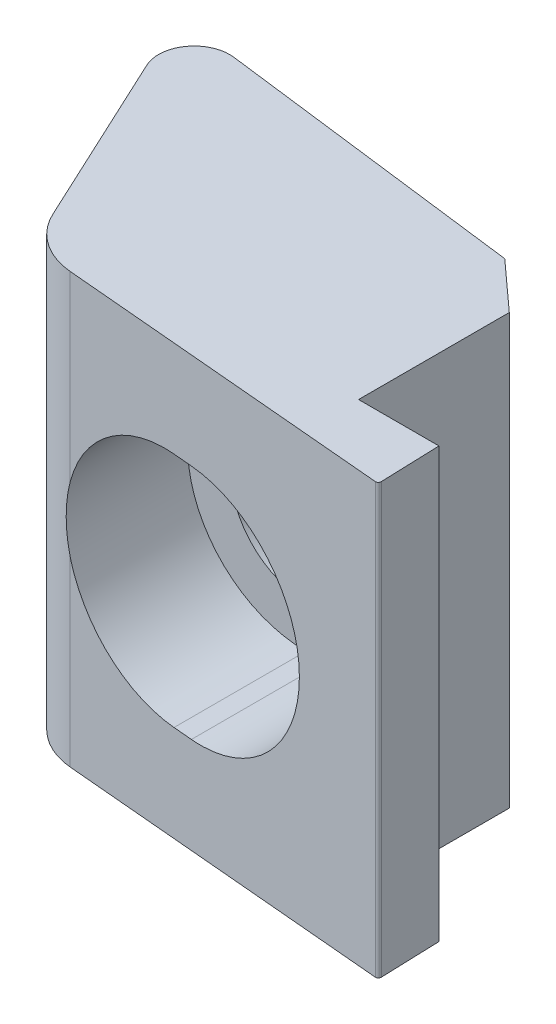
ISO-10303-21;
HEADER;
FILE_DESCRIPTION(('STEP AP214'),'2;1');
FILE_NAME('part.step','',(''),(''),'','','');
FILE_SCHEMA(('AUTOMOTIVE_DESIGN { 1 0 10303 214 1 1 1 1 }'));
ENDSEC;
DATA;
#1=APPLICATION_CONTEXT('core data for automotive mechanical design processes');
#2=APPLICATION_PROTOCOL_DEFINITION('international standard','automotive_design',2000,#1);
#3=PRODUCT_CONTEXT('',#1,'mechanical');
#4=PRODUCT('Part','Part','',(#3));
#5=PRODUCT_RELATED_PRODUCT_CATEGORY('part','',(#4));
#6=PRODUCT_DEFINITION_FORMATION('','',#4);
#7=PRODUCT_DEFINITION_CONTEXT('part definition',#1,'design');
#8=PRODUCT_DEFINITION('design','',#6,#7);
#9=PRODUCT_DEFINITION_SHAPE('','',#8);
#10=(LENGTH_UNIT() NAMED_UNIT(*) SI_UNIT(.MILLI.,.METRE.));
#11=(NAMED_UNIT(*) PLANE_ANGLE_UNIT() SI_UNIT($,.RADIAN.));
#12=(NAMED_UNIT(*) SI_UNIT($,.STERADIAN.) SOLID_ANGLE_UNIT());
#13=UNCERTAINTY_MEASURE_WITH_UNIT(LENGTH_MEASURE(1.E-05),#10,'distance_accuracy_value','');
#14=(GEOMETRIC_REPRESENTATION_CONTEXT(3) GLOBAL_UNCERTAINTY_ASSIGNED_CONTEXT((#13)) GLOBAL_UNIT_ASSIGNED_CONTEXT((#10,
#11,#12)) REPRESENTATION_CONTEXT('',''));
#15=CARTESIAN_POINT('',(0.,0.,0.));
#16=DIRECTION('',(0.,0.,1.));
#17=DIRECTION('',(1.,0.,0.));
#18=AXIS2_PLACEMENT_3D('',#15,#16,#17);
#19=CARTESIAN_POINT('',(-1.7018,0.,2.96963842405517E-10));
#20=DIRECTION('',(1.74528484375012E-10,0.,1.));
#21=DIRECTION('',(0.,1.,0.));
#22=AXIS2_PLACEMENT_3D('',#19,#20,#21);
#23=CYLINDRICAL_SURFACE('',#22,6.7437);
#24=CARTESIAN_POINT('',(-1.70179999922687,0.,4.42985585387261));
#25=DIRECTION('',(0.,0.,-1.));
#26=DIRECTION('',(-1.,0.,0.));
#27=AXIS2_PLACEMENT_3D('',#24,#25,#26);
#28=CIRCLE('',#27,6.7437);
#29=CARTESIAN_POINT('',(-1.70179999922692,6.7437,4.42985585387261));
#30=VERTEX_POINT('',#29);
#31=CARTESIAN_POINT('',(-1.70179999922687,-6.7437,4.42985585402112));
#32=VERTEX_POINT('',#31);
#33=EDGE_CURVE('E555',#30,#32,#28,.F.);
#34=ORIENTED_EDGE('',*,*,#33,.F.);
#35=DIRECTION('',(1.74528484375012E-10,0.,1.));
#36=VECTOR('',#35,1.);
#37=CARTESIAN_POINT('',(-1.70180000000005,6.7437,2.96963842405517E-10));
#38=LINE('',#37,#36);
#39=CARTESIAN_POINT('',(-1.70179999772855,6.7437,13.0150558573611));
#40=VERTEX_POINT('',#39);
#41=EDGE_CURVE('E370',#30,#40,#38,.T.);
#42=ORIENTED_EDGE('',*,*,#41,.T.);
#43=CARTESIAN_POINT('',(-1.7017999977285,0.,13.0150558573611));
#44=DIRECTION('',(1.74528484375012E-10,0.,1.));
#45=DIRECTION('',(0.,1.,0.));
#46=AXIS2_PLACEMENT_3D('',#43,#44,#45);
#47=CIRCLE('',#46,6.7437);
#48=CARTESIAN_POINT('',(-1.7017999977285,-6.7437,13.0150558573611));
#49=VERTEX_POINT('',#48);
#50=EDGE_CURVE('E358',#40,#49,#47,.T.);
#51=ORIENTED_EDGE('',*,*,#50,.T.);
#52=DIRECTION('',(1.74528484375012E-10,0.,1.));
#53=VECTOR('',#52,1.);
#54=CARTESIAN_POINT('',(-1.7018,-6.7437,2.96963842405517E-10));
#55=LINE('',#54,#53);
#56=EDGE_CURVE('E377',#32,#49,#55,.T.);
#57=ORIENTED_EDGE('',*,*,#56,.F.);
#58=EDGE_LOOP('',(#34,#42,#51,#57));
#59=FACE_BOUND('',#58,.T.);
#60=ADVANCED_FACE('F14',(#59),#23,.F.);
#61=CARTESIAN_POINT('',(-1.70180000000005,6.7437,2.96963842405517E-10));
#62=DIRECTION('',(0.,1.,0.));
#63=DIRECTION('',(-1.,0.,1.74528484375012E-10));
#64=AXIS2_PLACEMENT_3D('',#61,#62,#63);
#65=PLANE('',#64);
#66=DIRECTION('',(-1.,0.,0.));
#67=VECTOR('',#66,1.);
#68=CARTESIAN_POINT('',(-1.7018,6.7437,4.42985585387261));
#69=LINE('',#68,#67);
#70=CARTESIAN_POINT('',(7.73086455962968E-10,6.7437,4.4298558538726));
#71=VERTEX_POINT('',#70);
#72=EDGE_CURVE('E536',#71,#30,#69,.T.);
#73=ORIENTED_EDGE('',*,*,#72,.F.);
#74=DIRECTION('',(1.74528484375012E-10,0.,1.));
#75=VECTOR('',#74,1.);
#76=CARTESIAN_POINT('',(0.,6.7437,0.));
#77=LINE('',#76,#75);
#78=CARTESIAN_POINT('',(2.27145038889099E-09,6.7437,13.0150558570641));
#79=VERTEX_POINT('',#78);
#80=EDGE_CURVE('E374',#71,#79,#77,.T.);
#81=ORIENTED_EDGE('',*,*,#80,.T.);
#82=DIRECTION('',(-1.,0.,1.74528484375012E-10));
#83=VECTOR('',#82,1.);
#84=CARTESIAN_POINT('',(-1.70179999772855,6.7437,13.0150558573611));
#85=LINE('',#84,#83);
#86=EDGE_CURVE('E544',#79,#40,#85,.T.);
#87=ORIENTED_EDGE('',*,*,#86,.T.);
#88=ORIENTED_EDGE('',*,*,#41,.F.);
#89=EDGE_LOOP('',(#73,#81,#87,#88));
#90=FACE_BOUND('',#89,.T.);
#91=ADVANCED_FACE('F331',(#90),#65,.F.);
#92=CARTESIAN_POINT('',(0.,0.,0.));
#93=DIRECTION('',(1.74528484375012E-10,0.,1.));
#94=DIRECTION('',(0.,1.,0.));
#95=AXIS2_PLACEMENT_3D('',#92,#93,#94);
#96=CYLINDRICAL_SURFACE('',#95,6.7437);
#97=CARTESIAN_POINT('',(7.73135028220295E-10,0.,4.4298558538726));
#98=DIRECTION('',(0.,0.,-1.));
#99=DIRECTION('',(-1.,0.,0.));
#100=AXIS2_PLACEMENT_3D('',#97,#98,#99);
#101=CIRCLE('',#100,6.7437);
#102=CARTESIAN_POINT('',(7.73135028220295E-10,-6.7437,4.4298558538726));
#103=VERTEX_POINT('',#102);
#104=EDGE_CURVE('E530',#103,#71,#101,.F.);
#105=ORIENTED_EDGE('',*,*,#104,.F.);
#106=DIRECTION('',(1.74528484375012E-10,0.,1.));
#107=VECTOR('',#106,1.);
#108=CARTESIAN_POINT('',(0.,-6.7437,0.));
#109=LINE('',#108,#107);
#110=CARTESIAN_POINT('',(2.27149896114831E-09,-6.7437,13.0150558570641));
#111=VERTEX_POINT('',#110);
#112=EDGE_CURVE('E533',#103,#111,#109,.T.);
#113=ORIENTED_EDGE('',*,*,#112,.T.);
#114=CARTESIAN_POINT('',(2.27149896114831E-09,0.,13.0150558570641));
#115=DIRECTION('',(1.74528484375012E-10,0.,1.));
#116=DIRECTION('',(0.,1.,0.));
#117=AXIS2_PLACEMENT_3D('',#114,#115,#116);
#118=CIRCLE('',#117,6.7437);
#119=EDGE_CURVE('E548',#111,#79,#118,.T.);
#120=ORIENTED_EDGE('',*,*,#119,.T.);
#121=ORIENTED_EDGE('',*,*,#80,.F.);
#122=EDGE_LOOP('',(#105,#113,#120,#121));
#123=FACE_BOUND('',#122,.T.);
#124=ADVANCED_FACE('F338',(#123),#96,.F.);
#125=CARTESIAN_POINT('',(-1.7018,-6.7437,2.96963842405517E-10));
#126=DIRECTION('',(0.,-1.,0.));
#127=DIRECTION('',(1.,0.,-1.74528484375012E-10));
#128=AXIS2_PLACEMENT_3D('',#125,#126,#127);
#129=PLANE('',#128);
#130=DIRECTION('',(1.,0.,0.));
#131=VECTOR('',#130,1.);
#132=CARTESIAN_POINT('',(-1.7018,-6.7437,4.42985585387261));
#133=LINE('',#132,#131);
#134=EDGE_CURVE('E228',#32,#103,#133,.T.);
#135=ORIENTED_EDGE('',*,*,#134,.F.);
#136=ORIENTED_EDGE('',*,*,#56,.T.);
#137=DIRECTION('',(1.,0.,-1.74528484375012E-10));
#138=VECTOR('',#137,1.);
#139=CARTESIAN_POINT('',(-1.7017999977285,-6.7437,13.0150558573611));
#140=LINE('',#139,#138);
#141=EDGE_CURVE('E541',#49,#111,#140,.T.);
#142=ORIENTED_EDGE('',*,*,#141,.T.);
#143=ORIENTED_EDGE('',*,*,#112,.F.);
#144=EDGE_LOOP('',(#135,#136,#142,#143));
#145=FACE_BOUND('',#144,.T.);
#146=ADVANCED_FACE('F343',(#145),#129,.F.);
#147=CARTESIAN_POINT('',(19.1007643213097,19.177,20.9398558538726));
#148=DIRECTION('',(0.,0.,1.));
#149=DIRECTION('',(1.,0.,0.));
#150=AXIS2_PLACEMENT_3D('',#147,#148,#149);
#151=PLANE('',#150);
#152=DIRECTION('',(-1.,0.,0.));
#153=VECTOR('',#152,1.);
#154=CARTESIAN_POINT('',(19.1007643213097,19.177,20.9398558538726));
#155=LINE('',#154,#153);
#156=CARTESIAN_POINT('',(18.1037973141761,19.177,20.9398558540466));
#157=VERTEX_POINT('',#156);
#158=CARTESIAN_POINT('',(10.9202674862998,19.177,20.9398558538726));
#159=VERTEX_POINT('',#158);
#160=EDGE_CURVE('E565',#157,#159,#155,.T.);
#161=ORIENTED_EDGE('',*,*,#160,.F.);
#162=DIRECTION('',(0.,-1.,0.));
#163=VECTOR('',#162,1.);
#164=CARTESIAN_POINT('',(18.1037973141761,19.177,20.9398558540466));
#165=LINE('',#164,#163);
#166=CARTESIAN_POINT('',(18.1037973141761,-19.177,20.9398558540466));
#167=VERTEX_POINT('',#166);
#168=EDGE_CURVE('E537',#157,#167,#165,.T.);
#169=ORIENTED_EDGE('',*,*,#168,.T.);
#170=DIRECTION('',(-1.,0.,0.));
#171=VECTOR('',#170,1.);
#172=CARTESIAN_POINT('',(19.1007643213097,-19.177,20.9398558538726));
#173=LINE('',#172,#171);
#174=CARTESIAN_POINT('',(10.9202674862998,-19.177,20.9398558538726));
#175=VERTEX_POINT('',#174);
#176=EDGE_CURVE('E299',#167,#175,#173,.T.);
#177=ORIENTED_EDGE('',*,*,#176,.T.);
#178=DIRECTION('',(0.,-1.,0.));
#179=VECTOR('',#178,1.);
#180=CARTESIAN_POINT('',(10.9202674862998,19.177,20.9398558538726));
#181=LINE('',#180,#179);
#182=EDGE_CURVE('E212',#159,#175,#181,.T.);
#183=ORIENTED_EDGE('',*,*,#182,.F.);
#184=EDGE_LOOP('',(#161,#169,#177,#183));
#185=FACE_BOUND('',#184,.T.);
#186=ADVANCED_FACE('F16',(#185),#151,.F.);
#187=CARTESIAN_POINT('',(10.9202674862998,19.177,20.9398558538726));
#188=DIRECTION('',(-1.,0.,1.74528677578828E-10));
#189=DIRECTION('',(1.74528677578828E-10,0.,1.));
#190=AXIS2_PLACEMENT_3D('',#187,#188,#189);
#191=PLANE('',#190);
#192=DIRECTION('',(-1.74528677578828E-10,0.,-1.));
#193=VECTOR('',#192,1.);
#194=CARTESIAN_POINT('',(10.9202674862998,-19.177,20.9398558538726));
#195=LINE('',#194,#193);
#196=CARTESIAN_POINT('',(10.9202674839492,-19.177,7.4717719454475));
#197=VERTEX_POINT('',#196);
#198=EDGE_CURVE('E594',#175,#197,#195,.T.);
#199=ORIENTED_EDGE('',*,*,#198,.T.);
#200=DIRECTION('',(0.,-1.,0.));
#201=VECTOR('',#200,1.);
#202=CARTESIAN_POINT('',(10.9202674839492,19.177,7.4717719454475));
#203=LINE('',#202,#201);
#204=CARTESIAN_POINT('',(10.9202674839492,19.177,7.4717719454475));
#205=VERTEX_POINT('',#204);
#206=EDGE_CURVE('E209',#205,#197,#203,.T.);
#207=ORIENTED_EDGE('',*,*,#206,.F.);
#208=DIRECTION('',(-1.74528677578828E-10,0.,-1.));
#209=VECTOR('',#208,1.);
#210=CARTESIAN_POINT('',(10.9202674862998,19.177,20.9398558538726));
#211=LINE('',#210,#209);
#212=EDGE_CURVE('E569',#159,#205,#211,.T.);
#213=ORIENTED_EDGE('',*,*,#212,.F.);
#214=ORIENTED_EDGE('',*,*,#182,.T.);
#215=EDGE_LOOP('',(#199,#207,#213,#214));
#216=FACE_BOUND('',#215,.T.);
#217=ADVANCED_FACE('F489',(#216),#191,.F.);
#218=CARTESIAN_POINT('',(10.9202674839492,19.177,7.4717719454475));
#219=DIRECTION('',(-0.671723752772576,0.,0.740801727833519));
#220=DIRECTION('',(0.740801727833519,0.,0.671723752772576));
#221=AXIS2_PLACEMENT_3D('',#218,#219,#220);
#222=PLANE('',#221);
#223=DIRECTION('',(0.,-1.,0.));
#224=VECTOR('',#223,1.);
#225=CARTESIAN_POINT('',(6.55038663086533,19.177,3.50937194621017));
#226=LINE('',#225,#224);
#227=CARTESIAN_POINT('',(6.55038663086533,-9.207329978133,3.50937194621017));
#228=VERTEX_POINT('',#227);
#229=CARTESIAN_POINT('',(6.55038663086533,-19.177,3.50937194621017));
#230=VERTEX_POINT('',#229);
#231=EDGE_CURVE('E42',#228,#230,#226,.T.);
#232=ORIENTED_EDGE('',*,*,#231,.F.);
#233=CARTESIAN_POINT('',(6.55038663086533,-9.20732997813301,3.50937194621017));
#234=CARTESIAN_POINT('',(6.63649891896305,-9.04611805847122,3.58745447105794));
#235=CARTESIAN_POINT('',(6.71727948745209,-8.87978552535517,3.66070244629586));
#236=CARTESIAN_POINT('',(6.86797450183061,-8.53850616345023,3.79734551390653));
#237=CARTESIAN_POINT('',(6.93789542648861,-8.36356455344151,3.86074648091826));
#238=CARTESIAN_POINT('',(7.06525325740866,-8.01070503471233,3.97622850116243));
#239=CARTESIAN_POINT('',(7.12294555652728,-7.83295445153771,4.02854113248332));
#240=CARTESIAN_POINT('',(7.2278155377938,-7.47187203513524,4.12363224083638));
#241=CARTESIAN_POINT('',(7.2749920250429,-7.28853957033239,4.16640963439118));
#242=CARTESIAN_POINT('',(7.35768573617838,-6.92241746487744,4.24139235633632));
#243=CARTESIAN_POINT('',(7.39347678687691,-6.73974017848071,4.27384597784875));
#244=CARTESIAN_POINT('',(7.45503491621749,-6.37134404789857,4.32966396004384));
#245=CARTESIAN_POINT('',(7.480802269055,-6.18562528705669,4.35302856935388));
#246=CARTESIAN_POINT('',(7.52279275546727,-5.80774036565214,4.39110354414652));
#247=CARTESIAN_POINT('',(7.53877588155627,-5.61552557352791,4.40559628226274));
#248=CARTESIAN_POINT('',(7.56013296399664,-5.23003082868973,4.42496186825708));
#249=CARTESIAN_POINT('',(7.56550720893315,-5.03675090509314,4.42983497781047));
#250=CARTESIAN_POINT('',(7.56553023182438,-4.84346583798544,4.4298558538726));
#251=B_SPLINE_CURVE_WITH_KNOTS('',3,(#233,#234,#235,#236,#237,#238,#239,#240,#241,#242,#243,
#244,#245,#246,#247,#248,#249,#250),.UNSPECIFIED.,.F.,.F.,(4,2,2,2,2,2,2,2,4),(0.,
0.595974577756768,1.19159222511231,1.77317189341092,2.35481761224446,2.9211774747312,
3.48752184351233,4.06725364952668,4.64696968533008),.UNSPECIFIED.);
#252=CARTESIAN_POINT('',(7.56553023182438,-4.84346583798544,4.4298558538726));
#253=VERTEX_POINT('',#252);
#254=EDGE_CURVE('E9',#228,#253,#251,.T.);
#255=ORIENTED_EDGE('',*,*,#254,.T.);
#256=DIRECTION('',(0.,-1.,0.));
#257=VECTOR('',#256,1.);
#258=CARTESIAN_POINT('',(7.56553023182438,19.177,4.4298558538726));
#259=LINE('',#258,#257);
#260=CARTESIAN_POINT('',(7.56553023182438,4.84346583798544,4.4298558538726));
#261=VERTEX_POINT('',#260);
#262=EDGE_CURVE('E552',#261,#253,#259,.T.);
#263=ORIENTED_EDGE('',*,*,#262,.F.);
#264=CARTESIAN_POINT('',(7.56553023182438,4.84346583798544,4.4298558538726));
#265=CARTESIAN_POINT('',(7.56552773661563,4.95445711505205,4.42985359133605));
#266=CARTESIAN_POINT('',(7.56375019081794,5.06544451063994,4.42824179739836));
#267=CARTESIAN_POINT('',(7.55667892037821,5.28718244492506,4.42182990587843));
#268=CARTESIAN_POINT('',(7.55138623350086,5.39793304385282,4.41703074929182));
#269=CARTESIAN_POINT('',(7.53028042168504,5.72965219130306,4.3978930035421));
#270=CARTESIAN_POINT('',(7.50923958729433,5.95001993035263,4.37881417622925));
#271=CARTESIAN_POINT('',(7.42677883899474,6.59458212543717,4.30404269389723));
#272=CARTESIAN_POINT('',(7.3459908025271,7.01463913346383,4.23078794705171));
#273=CARTESIAN_POINT('',(7.15661581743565,7.73606758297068,4.05907172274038));
#274=CARTESIAN_POINT('',(7.05862970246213,8.04259176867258,3.97022257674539));
#275=CARTESIAN_POINT('',(6.8295881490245,8.64035577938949,3.7625385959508));
#276=CARTESIAN_POINT('',(6.69788221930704,8.93114018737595,3.64311392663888));
#277=CARTESIAN_POINT('',(6.55038663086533,9.20732997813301,3.50937194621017));
#278=B_SPLINE_CURVE_WITH_KNOTS('',3,(#264,#265,#266,#267,#268,#269,#270,#271,#272,#273,#274,
#275,#276,#277),.UNSPECIFIED.,.F.,.F.,(4,2,2,2,2,2,4),(0.,0.332941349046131,0.665784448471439,
1.33167438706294,2.62670440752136,3.62520698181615,4.64465215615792),.UNSPECIFIED.);
#279=CARTESIAN_POINT('',(6.55038663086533,9.20732997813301,3.50937194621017));
#280=VERTEX_POINT('',#279);
#281=EDGE_CURVE('E238',#261,#280,#278,.T.);
#282=ORIENTED_EDGE('',*,*,#281,.T.);
#283=CARTESIAN_POINT('',(6.55038663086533,19.177,3.50937194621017));
#284=VERTEX_POINT('',#283);
#285=EDGE_CURVE('E207',#284,#280,#226,.T.);
#286=ORIENTED_EDGE('',*,*,#285,.F.);
#287=DIRECTION('',(-0.740801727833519,0.,-0.671723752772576));
#288=VECTOR('',#287,1.);
#289=CARTESIAN_POINT('',(10.9202674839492,19.177,7.4717719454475));
#290=LINE('',#289,#288);
#291=EDGE_CURVE('E571',#205,#284,#290,.T.);
#292=ORIENTED_EDGE('',*,*,#291,.F.);
#293=ORIENTED_EDGE('',*,*,#206,.T.);
#294=DIRECTION('',(-0.740801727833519,0.,-0.671723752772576));
#295=VECTOR('',#294,1.);
#296=CARTESIAN_POINT('',(10.9202674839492,-19.177,7.4717719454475));
#297=LINE('',#296,#295);
#298=EDGE_CURVE('E593',#197,#230,#297,.T.);
#299=ORIENTED_EDGE('',*,*,#298,.T.);
#300=EDGE_LOOP('',(#232,#255,#263,#282,#286,#292,#293,#299));
#301=FACE_BOUND('',#300,.T.);
#302=ADVANCED_FACE('F251',(#301),#222,.F.);
#303=CARTESIAN_POINT('',(6.55038663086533,19.177,3.50937194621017));
#304=DIRECTION('',(-0.124834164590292,0.,0.992177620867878));
#305=DIRECTION('',(0.992177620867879,0.,0.124834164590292));
#306=AXIS2_PLACEMENT_3D('',#303,#304,#305);
#307=PLANE('',#306);
#308=ORIENTED_EDGE('',*,*,#285,.T.);
#309=CARTESIAN_POINT('',(6.55038663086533,9.20732997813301,3.50937194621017));
#310=CARTESIAN_POINT('',(6.31240206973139,9.44221241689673,3.47942911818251));
#311=CARTESIAN_POINT('',(6.06460979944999,9.66701435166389,3.44825230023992));
#312=CARTESIAN_POINT('',(5.55115372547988,10.0948519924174,3.38365009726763));
#313=CARTESIAN_POINT('',(5.2854891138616,10.2978867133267,3.35022461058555));
#314=CARTESIAN_POINT('',(4.73813440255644,10.6805070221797,3.28135733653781));
#315=CARTESIAN_POINT('',(4.45644902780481,10.8600994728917,3.24591614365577));
#316=CARTESIAN_POINT('',(3.87896939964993,11.1945085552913,3.17325860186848));
#317=CARTESIAN_POINT('',(3.58317578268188,11.3493263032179,3.13604233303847));
#318=CARTESIAN_POINT('',(2.98028497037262,11.6326601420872,3.06018759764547));
#319=CARTESIAN_POINT('',(2.67321605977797,11.7612373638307,3.02155268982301));
#320=CARTESIAN_POINT('',(2.0493236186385,11.9915712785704,2.94305556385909));
#321=CARTESIAN_POINT('',(1.73249992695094,12.0933275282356,2.90319332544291));
#322=CARTESIAN_POINT('',(1.09155059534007,12.2692181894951,2.82255012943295));
#323=CARTESIAN_POINT('',(0.767428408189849,12.3433653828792,2.78176960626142));
#324=CARTESIAN_POINT('',(0.114104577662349,12.4635736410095,2.69956947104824));
#325=CARTESIAN_POINT('',(-0.21509694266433,12.5096353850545,2.65814987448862));
#326=CARTESIAN_POINT('',(-0.872733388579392,12.5730431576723,2.57540713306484));
#327=CARTESIAN_POINT('',(-1.20114035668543,12.5906843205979,2.53408750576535));
#328=CARTESIAN_POINT('',(-1.85825722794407,12.5981058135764,2.45141013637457));
#329=CARTESIAN_POINT('',(-2.18696712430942,12.5878867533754,2.41005239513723));
#330=CARTESIAN_POINT('',(-2.8424516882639,12.5397333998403,2.32758039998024));
#331=CARTESIAN_POINT('',(-3.16922588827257,12.5017926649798,2.2864662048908));
#332=CARTESIAN_POINT('',(-3.81845761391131,12.3985486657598,2.20478093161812));
#333=CARTESIAN_POINT('',(-4.14091577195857,12.3332494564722,2.16420977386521));
#334=CARTESIAN_POINT('',(-4.71021796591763,12.1929002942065,2.09258110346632));
#335=CARTESIAN_POINT('',(-4.9583300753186,12.1230149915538,2.0613640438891));
#336=CARTESIAN_POINT('',(-5.44950307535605,11.9671601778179,1.99956546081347));
#337=CARTESIAN_POINT('',(-5.69256467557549,11.8811929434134,1.96898384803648));
#338=CARTESIAN_POINT('',(-6.17228293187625,11.6937346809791,1.90862648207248));
#339=CARTESIAN_POINT('',(-6.40894892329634,11.5922678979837,1.87884955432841));
#340=CARTESIAN_POINT('',(-6.87534929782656,11.3741987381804,1.82016782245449));
#341=CARTESIAN_POINT('',(-7.10508283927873,11.2575945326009,1.79126312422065));
#342=CARTESIAN_POINT('',(-7.33086284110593,11.1336764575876,1.7628558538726));
#343=B_SPLINE_CURVE_WITH_KNOTS('',3,(#309,#310,#311,#312,#313,#314,#315,#316,#317,#318,#319,
#320,#321,#322,#323,#324,#325,#326,#327,#328,#329,#330,#331,#332,#333,#334,#335,#336,#337,#338,
#339,#340,#341,#342),.UNSPECIFIED.,.F.,.F.,(4,2,2,2,2,2,2,2,2,2,2,2,2,2,2,2,4),(0.,
1.00685992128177,2.01376538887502,3.0203754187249,4.02694008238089,5.03113235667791,
6.0353412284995,7.0390846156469,8.04280372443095,9.03603088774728,10.0292363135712,
11.0226725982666,12.0159616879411,12.7943893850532,13.5727069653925,14.3498193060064,
15.127025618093),.UNSPECIFIED.);
#344=CARTESIAN_POINT('',(-7.33086284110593,11.1336764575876,1.7628558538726));
#345=VERTEX_POINT('',#344);
#346=EDGE_CURVE('E245',#280,#345,#343,.T.);
#347=ORIENTED_EDGE('',*,*,#346,.T.);
#348=CARTESIAN_POINT('',(-1.22093251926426,0.,2.53159728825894));
#349=DIRECTION('',(-0.124834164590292,0.,0.992177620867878));
#350=DIRECTION('',(-0.992177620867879,0.,-0.124834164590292));
#351=AXIS2_PLACEMENT_3D('',#348,#349,#350);
#352=ELLIPSE('',#351,12.8001274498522,12.7);
#353=CARTESIAN_POINT('',(-7.33086284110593,-11.1336764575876,1.7628558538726));
#354=VERTEX_POINT('',#353);
#355=EDGE_CURVE('E230',#345,#354,#352,.T.);
#356=ORIENTED_EDGE('',*,*,#355,.T.);
#357=CARTESIAN_POINT('',(-7.33086284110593,-11.1336764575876,1.7628558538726));
#358=CARTESIAN_POINT('',(-7.03591697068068,-11.2955809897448,1.7999654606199));
#359=CARTESIAN_POINT('',(-6.73420336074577,-11.4449768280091,1.83792657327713));
#360=CARTESIAN_POINT('',(-6.11937621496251,-11.7177012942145,1.9152831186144));
#361=CARTESIAN_POINT('',(-5.80626210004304,-11.841028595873,1.95467862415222));
#362=CARTESIAN_POINT('',(-5.17079409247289,-12.0605515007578,2.03463216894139));
#363=CARTESIAN_POINT('',(-4.84844002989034,-12.1567466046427,2.0751902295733));
#364=CARTESIAN_POINT('',(-4.19680065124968,-12.3211861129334,2.15717842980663));
#365=CARTESIAN_POINT('',(-3.86751564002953,-12.3894317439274,2.19860853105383));
#366=CARTESIAN_POINT('',(-3.20516915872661,-12.4972324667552,2.28194388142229));
#367=CARTESIAN_POINT('',(-2.87211874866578,-12.5368565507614,2.32384773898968));
#368=CARTESIAN_POINT('',(-2.20387087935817,-12.587295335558,2.40792559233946));
#369=CARTESIAN_POINT('',(-1.86867339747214,-12.5981097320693,2.45009959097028));
#370=CARTESIAN_POINT('',(-1.19876942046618,-12.5907698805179,2.53438581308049));
#371=CARTESIAN_POINT('',(-0.864062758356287,-12.5726311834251,2.5764980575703));
#372=CARTESIAN_POINT('',(-0.197433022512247,-12.5074888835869,2.6603723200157));
#373=CARTESIAN_POINT('',(0.134490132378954,-12.4604861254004,2.70213434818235));
#374=CARTESIAN_POINT('',(0.788153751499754,-12.3388509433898,2.78437723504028));
#375=CARTESIAN_POINT('',(1.10997227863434,-12.2646442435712,2.82486791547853));
#376=CARTESIAN_POINT('',(1.74622398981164,-12.0890549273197,2.90492006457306));
#377=CARTESIAN_POINT('',(2.06065728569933,-11.9876727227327,2.94448154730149));
#378=CARTESIAN_POINT('',(2.67993374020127,-11.7584630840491,3.02239789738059));
#379=CARTESIAN_POINT('',(2.98477545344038,-11.6306316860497,3.06075258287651));
#380=CARTESIAN_POINT('',(3.58262979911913,-11.3495003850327,3.13597363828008));
#381=CARTESIAN_POINT('',(3.87564441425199,-11.1962047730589,3.17284025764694));
#382=CARTESIAN_POINT('',(4.3790628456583,-10.9050825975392,3.23617954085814));
#383=CARTESIAN_POINT('',(4.59240577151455,-10.7723831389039,3.26302199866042));
#384=CARTESIAN_POINT('',(5.01025790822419,-10.4935481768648,3.31559547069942));
#385=CARTESIAN_POINT('',(5.21476774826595,-10.3474136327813,3.34132656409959));
#386=CARTESIAN_POINT('',(5.61384701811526,-10.0425870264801,3.39153806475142));
#387=CARTESIAN_POINT('',(5.80843147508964,-9.88391493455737,3.41602036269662));
#388=CARTESIAN_POINT('',(6.18731233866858,-9.55449778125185,3.46369053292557));
#389=CARTESIAN_POINT('',(6.37160736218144,-9.38375110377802,3.48687823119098));
#390=CARTESIAN_POINT('',(6.55038663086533,-9.20732997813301,3.50937194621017));
#391=B_SPLINE_CURVE_WITH_KNOTS('',3,(#357,#358,#359,#360,#361,#362,#363,#364,#365,#366,#367,
#368,#369,#370,#371,#372,#373,#374,#375,#376,#377,#378,#379,#380,#381,#382,#383,#384,#385,#386,
#387,#388,#389,#390),.UNSPECIFIED.,.F.,.F.,(4,2,2,2,2,2,2,2,2,2,2,2,2,2,2,2,4),(0.,
1.01521980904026,2.0304912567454,3.04578138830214,4.06102695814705,5.07381703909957,
6.08661781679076,7.09887479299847,8.11110215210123,9.10812158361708,10.105125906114,
11.1022797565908,12.0992657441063,12.8568061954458,13.6142925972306,14.3705958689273,
15.1270005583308),.UNSPECIFIED.);
#392=EDGE_CURVE('E28',#354,#228,#391,.T.);
#393=ORIENTED_EDGE('',*,*,#392,.T.);
#394=ORIENTED_EDGE('',*,*,#231,.T.);
#395=DIRECTION('',(-0.992177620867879,0.,-0.124834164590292));
#396=VECTOR('',#395,1.);
#397=CARTESIAN_POINT('',(6.55038663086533,-19.177,3.50937194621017));
#398=LINE('',#397,#396);
#399=CARTESIAN_POINT('',(-21.1445840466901,-19.177,0.0248360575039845));
#400=VERTEX_POINT('',#399);
#401=EDGE_CURVE('E591',#230,#400,#398,.T.);
#402=ORIENTED_EDGE('',*,*,#401,.T.);
#403=DIRECTION('',(0.,-1.,0.));
#404=VECTOR('',#403,1.);
#405=CARTESIAN_POINT('',(-21.1445840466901,19.177,0.0248360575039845));
#406=LINE('',#405,#404);
#407=CARTESIAN_POINT('',(-21.1445840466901,19.177,0.0248360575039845));
#408=VERTEX_POINT('',#407);
#409=EDGE_CURVE('E204',#408,#400,#406,.T.);
#410=ORIENTED_EDGE('',*,*,#409,.F.);
#411=DIRECTION('',(-0.992177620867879,0.,-0.124834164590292));
#412=VECTOR('',#411,1.);
#413=CARTESIAN_POINT('',(6.55038663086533,19.177,3.50937194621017));
#414=LINE('',#413,#412);
#415=EDGE_CURVE('E577',#284,#408,#414,.T.);
#416=ORIENTED_EDGE('',*,*,#415,.F.);
#417=EDGE_LOOP('',(#308,#347,#356,#393,#394,#402,#410,#416));
#418=FACE_BOUND('',#417,.T.);
#419=ADVANCED_FACE('F270',(#418),#307,.F.);
#420=CARTESIAN_POINT('',(-21.5409325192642,19.177,3.17500000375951));
#421=DIRECTION('',(0.,-1.,0.));
#422=DIRECTION('',(1.,0.,-1.74528484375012E-10));
#423=AXIS2_PLACEMENT_3D('',#420,#421,#422);
#424=CYLINDRICAL_SURFACE('',#423,3.175);
#425=CARTESIAN_POINT('',(-21.5409325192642,-19.177,3.17500000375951));
#426=DIRECTION('',(0.,1.,0.));
#427=DIRECTION('',(-1.,0.,1.74528484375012E-10));
#428=AXIS2_PLACEMENT_3D('',#425,#426,#427);
#429=CIRCLE('',#428,3.175);
#430=CARTESIAN_POINT('',(-24.4185421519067,-19.177,4.51663624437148));
#431=VERTEX_POINT('',#430);
#432=EDGE_CURVE('E587',#400,#431,#429,.T.);
#433=ORIENTED_EDGE('',*,*,#432,.T.);
#434=DIRECTION('',(0.,-1.,0.));
#435=VECTOR('',#434,1.);
#436=CARTESIAN_POINT('',(-24.4185421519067,19.177,4.51663624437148));
#437=LINE('',#436,#435);
#438=CARTESIAN_POINT('',(-24.4185421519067,19.177,4.51663624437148));
#439=VERTEX_POINT('',#438);
#440=EDGE_CURVE('E201',#439,#431,#437,.T.);
#441=ORIENTED_EDGE('',*,*,#440,.F.);
#442=CARTESIAN_POINT('',(-21.5409325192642,19.177,3.17500000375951));
#443=DIRECTION('',(0.,1.,0.));
#444=DIRECTION('',(-1.,0.,1.74528484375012E-10));
#445=AXIS2_PLACEMENT_3D('',#442,#443,#444);
#446=CIRCLE('',#445,3.175);
#447=EDGE_CURVE('E579',#408,#439,#446,.T.);
#448=ORIENTED_EDGE('',*,*,#447,.F.);
#449=ORIENTED_EDGE('',*,*,#409,.T.);
#450=EDGE_LOOP('',(#433,#441,#448,#449));
#451=FACE_BOUND('',#450,.T.);
#452=ADVANCED_FACE('F274',(#451),#424,.T.);
#453=CARTESIAN_POINT('',(-24.4185421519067,19.177,4.51663624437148));
#454=DIRECTION('',(0.90633374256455,0.,-0.422562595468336));
#455=DIRECTION('',(-0.422562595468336,0.,-0.90633374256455));
#456=AXIS2_PLACEMENT_3D('',#453,#454,#455);
#457=PLANE('',#456);
#458=DIRECTION('',(0.422562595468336,0.,0.90633374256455));
#459=VECTOR('',#458,1.);
#460=CARTESIAN_POINT('',(-24.4185421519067,-19.177,4.51663624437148));
#461=LINE('',#460,#459);
#462=CARTESIAN_POINT('',(-17.0733894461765,-19.177,20.2708932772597));
#463=VERTEX_POINT('',#462);
#464=EDGE_CURVE('E585',#431,#463,#461,.T.);
#465=ORIENTED_EDGE('',*,*,#464,.T.);
#466=DIRECTION('',(0.,-1.,0.));
#467=VECTOR('',#466,1.);
#468=CARTESIAN_POINT('',(-17.0733894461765,19.177,20.2708932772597));
#469=LINE('',#468,#467);
#470=CARTESIAN_POINT('',(-17.0733894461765,19.177,20.2708932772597));
#471=VERTEX_POINT('',#470);
#472=EDGE_CURVE('E198',#471,#463,#469,.T.);
#473=ORIENTED_EDGE('',*,*,#472,.F.);
#474=DIRECTION('',(0.422562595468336,0.,0.90633374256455));
#475=VECTOR('',#474,1.);
#476=CARTESIAN_POINT('',(-24.4185421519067,19.177,4.51663624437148));
#477=LINE('',#476,#475);
#478=EDGE_CURVE('E194',#439,#471,#477,.T.);
#479=ORIENTED_EDGE('',*,*,#478,.F.);
#480=ORIENTED_EDGE('',*,*,#440,.T.);
#481=EDGE_LOOP('',(#465,#473,#479,#480));
#482=FACE_BOUND('',#481,.T.);
#483=ADVANCED_FACE('F279',(#482),#457,.F.);
#484=CARTESIAN_POINT('',(-11.3181701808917,19.177,17.5876207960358));
#485=DIRECTION('',(0.,-1.,0.));
#486=DIRECTION('',(1.,0.,-1.74528484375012E-10));
#487=AXIS2_PLACEMENT_3D('',#484,#485,#486);
#488=CYLINDRICAL_SURFACE('',#487,6.35);
#489=DIRECTION('',(0.,-1.,0.));
#490=VECTOR('',#489,1.);
#491=CARTESIAN_POINT('',(-11.8742648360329,19.177,23.9132242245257));
#492=LINE('',#491,#490);
#493=CARTESIAN_POINT('',(-11.8742648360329,-2.90487794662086,23.9132242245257));
#494=VERTEX_POINT('',#493);
#495=CARTESIAN_POINT('',(-11.8742648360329,-19.177,23.9132242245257));
#496=VERTEX_POINT('',#495);
#497=EDGE_CURVE('E190',#494,#496,#492,.T.);
#498=ORIENTED_EDGE('',*,*,#497,.F.);
#499=CARTESIAN_POINT('',(-4.96817018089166,10.0622155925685,17.5876207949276));
#500=CARTESIAN_POINT('',(-4.96817012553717,10.0622155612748,17.4197208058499));
#501=CARTESIAN_POINT('',(-4.97483422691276,10.0600596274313,17.2518217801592));
#502=CARTESIAN_POINT('',(-5.00143086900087,10.051367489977,16.9171920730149));
#503=CARTESIAN_POINT('',(-5.02136331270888,10.04483131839,16.7504613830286));
#504=CARTESIAN_POINT('',(-5.07431472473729,10.0271770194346,16.4193404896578));
#505=CARTESIAN_POINT('',(-5.10733332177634,10.0160590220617,16.2549502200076));
#506=CARTESIAN_POINT('',(-5.18614613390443,9.98891506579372,15.9296752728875));
#507=CARTESIAN_POINT('',(-5.23194013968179,9.97288918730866,15.7687905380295));
#508=CARTESIAN_POINT('',(-5.33590769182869,9.93547539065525,15.4515189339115));
#509=CARTESIAN_POINT('',(-5.39409426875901,9.91408182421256,15.2951369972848));
#510=CARTESIAN_POINT('',(-5.5222084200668,9.86542083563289,14.9882013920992));
#511=CARTESIAN_POINT('',(-5.59213598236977,9.83815341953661,14.8376477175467));
#512=CARTESIAN_POINT('',(-5.74293046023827,9.77717903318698,14.5435272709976));
#513=CARTESIAN_POINT('',(-5.82379468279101,9.74347364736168,14.3999587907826));
#514=CARTESIAN_POINT('',(-5.99550568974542,9.66903300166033,14.1208372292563));
#515=CARTESIAN_POINT('',(-6.08635225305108,9.62829789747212,13.9852839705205));
#516=CARTESIAN_POINT('',(-6.27515782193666,9.54004261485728,13.7255171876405));
#517=CARTESIAN_POINT('',(-6.37296004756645,9.49265722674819,13.6011438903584));
#518=CARTESIAN_POINT('',(-6.57580120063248,9.39012127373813,13.3618622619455));
#519=CARTESIAN_POINT('',(-6.68083998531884,9.33497086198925,13.2469537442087));
#520=CARTESIAN_POINT('',(-6.89671290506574,9.21658189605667,13.0272559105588));
#521=CARTESIAN_POINT('',(-7.00754557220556,9.15334538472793,12.9224640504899));
#522=CARTESIAN_POINT('',(-7.23351539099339,9.01857985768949,12.7233870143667));
#523=CARTESIAN_POINT('',(-7.34865254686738,8.9470508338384,12.629101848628));
#524=CARTESIAN_POINT('',(-7.58009271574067,8.79669334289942,12.4524297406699));
#525=CARTESIAN_POINT('',(-7.69635887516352,8.71797673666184,12.3698990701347));
#526=CARTESIAN_POINT('',(-7.93007864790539,8.5525666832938,12.2151932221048));
#527=CARTESIAN_POINT('',(-8.04753222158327,8.46587350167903,12.1430177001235));
#528=CARTESIAN_POINT('',(-8.28225331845,8.28474303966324,12.0087323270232));
#529=CARTESIAN_POINT('',(-8.39952079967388,8.19030421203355,11.9466244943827));
#530=CARTESIAN_POINT('',(-8.63258295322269,7.99404973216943,11.8320153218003));
#531=CARTESIAN_POINT('',(-8.74837732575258,7.89223260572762,11.7795159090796));
#532=CARTESIAN_POINT('',(-9.0140767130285,7.64788331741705,11.6681166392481));
#533=CARTESIAN_POINT('',(-9.163014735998,7.50276374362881,11.6125616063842));
#534=CARTESIAN_POINT('',(-9.45417150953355,7.20152885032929,11.5154230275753));
#535=CARTESIAN_POINT('',(-9.59638845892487,7.04541061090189,11.4738432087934));
#536=CARTESIAN_POINT('',(-9.87264124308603,6.72308225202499,11.4026934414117));
#537=CARTESIAN_POINT('',(-10.0066634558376,6.55685619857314,11.3731430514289));
#538=CARTESIAN_POINT('',(-10.2650484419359,6.21562312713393,11.3241767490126));
#539=CARTESIAN_POINT('',(-10.3894089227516,6.04061404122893,11.3047632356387));
#540=CARTESIAN_POINT('',(-10.6626265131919,5.6301247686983,11.2696356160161));
#541=CARTESIAN_POINT('',(-10.8079064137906,5.39201936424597,11.2566964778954));
#542=CARTESIAN_POINT('',(-11.079328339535,4.90480895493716,11.2406572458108));
#543=CARTESIAN_POINT('',(-11.2054648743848,4.65570082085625,11.2375599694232));
#544=CARTESIAN_POINT('',(-11.4377087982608,4.14817514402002,11.2376834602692));
#545=CARTESIAN_POINT('',(-11.5438053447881,3.88975265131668,11.2409076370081));
#546=CARTESIAN_POINT('',(-11.7352059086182,3.36541478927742,11.2506052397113));
#547=CARTESIAN_POINT('',(-11.8205114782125,3.09949998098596,11.2570784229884));
#548=CARTESIAN_POINT('',(-11.9709308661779,2.55782520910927,11.2708021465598));
#549=CARTESIAN_POINT('',(-12.0357297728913,2.28197801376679,11.2780627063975));
#550=CARTESIAN_POINT('',(-12.1430000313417,1.72594023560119,11.2911868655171));
#551=CARTESIAN_POINT('',(-12.1854712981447,1.44574963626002,11.2970504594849));
#552=CARTESIAN_POINT('',(-12.2477809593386,0.883016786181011,11.3059555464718));
#553=CARTESIAN_POINT('',(-12.2676355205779,0.600476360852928,11.3089990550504));
#554=CARTESIAN_POINT('',(-12.2846283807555,0.0346946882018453,11.3115925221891));
#555=CARTESIAN_POINT('',(-12.2817663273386,-0.248546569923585,11.3111424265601));
#556=CARTESIAN_POINT('',(-12.25271163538,-0.826433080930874,11.3067477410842));
#557=CARTESIAN_POINT('',(-12.2254878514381,-1.12102575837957,11.3026487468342));
#558=CARTESIAN_POINT('',(-12.1464812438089,-1.70685764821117,11.2917505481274));
#559=CARTESIAN_POINT('',(-12.0946969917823,-1.99809666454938,11.2849511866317));
#560=CARTESIAN_POINT('',(-11.9668275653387,-2.57569610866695,11.2705102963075));
#561=CARTESIAN_POINT('',(-11.890700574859,-2.86204724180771,11.2628673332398));
#562=CARTESIAN_POINT('',(-11.7146894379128,-3.42739687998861,11.2493989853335));
#563=CARTESIAN_POINT('',(-11.6148056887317,-3.70639550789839,11.2435735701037));
#564=CARTESIAN_POINT('',(-11.391016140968,-4.25741843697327,11.2370437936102));
#565=CARTESIAN_POINT('',(-11.2669148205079,-4.52936405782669,11.2363830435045));
#566=CARTESIAN_POINT('',(-10.9961584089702,-5.06176187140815,11.2443451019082));
#567=CARTESIAN_POINT('',(-10.8494992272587,-5.32221196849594,11.2529695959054));
#568=CARTESIAN_POINT('',(-10.5355164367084,-5.82848839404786,11.2840685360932));
#569=CARTESIAN_POINT('',(-10.3682540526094,-6.07435498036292,11.3065027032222));
#570=CARTESIAN_POINT('',(-10.0149421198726,-6.54954066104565,11.3702053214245));
#571=CARTESIAN_POINT('',(-9.8289060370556,-6.77887141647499,11.4114603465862));
#572=CARTESIAN_POINT('',(-9.51375117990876,-7.13614569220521,11.4980862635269));
#573=CARTESIAN_POINT('',(-9.38928290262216,-7.27000210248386,11.5361831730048));
#574=CARTESIAN_POINT('',(-9.13546093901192,-7.52933693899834,11.6230368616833));
#575=CARTESIAN_POINT('',(-9.0061087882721,-7.65481796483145,11.6717903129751));
#576=CARTESIAN_POINT('',(-8.74398755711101,-7.89662794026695,11.7810530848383));
#577=CARTESIAN_POINT('',(-8.61122048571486,-8.01296211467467,11.841555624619));
#578=CARTESIAN_POINT('',(-8.34389510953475,-8.23591022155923,11.975266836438));
#579=CARTESIAN_POINT('',(-8.20933675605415,-8.34252388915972,12.0484758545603));
#580=CARTESIAN_POINT('',(-7.93938093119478,-8.54627132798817,12.2088559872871));
#581=CARTESIAN_POINT('',(-7.80398478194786,-8.64332756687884,12.2961282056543));
#582=CARTESIAN_POINT('',(-7.53557637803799,-8.82671130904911,12.4845468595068));
#583=CARTESIAN_POINT('',(-7.40256414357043,-8.91303872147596,12.585693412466));
#584=CARTESIAN_POINT('',(-7.14124936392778,-9.07487583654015,12.801749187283));
#585=CARTESIAN_POINT('',(-7.01294607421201,-9.15038725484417,12.9166562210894));
#586=CARTESIAN_POINT('',(-6.76330868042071,-9.29080198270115,13.1597457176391));
#587=CARTESIAN_POINT('',(-6.64197388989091,-9.35570633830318,13.2879268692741));
#588=CARTESIAN_POINT('',(-6.42173049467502,-9.46853417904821,13.5413546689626));
#589=CARTESIAN_POINT('',(-6.32184252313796,-9.51755013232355,13.6652682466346));
#590=CARTESIAN_POINT('',(-6.13052288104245,-9.60806807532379,13.9220451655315));
#591=CARTESIAN_POINT('',(-6.03909100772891,-9.6495702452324,14.0549082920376));
#592=CARTESIAN_POINT('',(-5.86584347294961,-9.72558754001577,14.3286525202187));
#593=CARTESIAN_POINT('',(-5.78402770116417,-9.76010274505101,14.4695335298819));
#594=CARTESIAN_POINT('',(-5.63098004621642,-9.8227155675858,14.7582973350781));
#595=CARTESIAN_POINT('',(-5.5597483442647,-9.85081307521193,14.906180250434));
#596=CARTESIAN_POINT('',(-5.42986153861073,-9.90069022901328,15.2051026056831));
#597=CARTESIAN_POINT('',(-5.37100031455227,-9.92257598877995,15.3560349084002));
#598=CARTESIAN_POINT('',(-5.26480982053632,-9.96120040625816,15.6626126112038));
#599=CARTESIAN_POINT('',(-5.21748535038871,-9.97793692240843,15.8182599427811));
#600=CARTESIAN_POINT('',(-5.13484565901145,-10.0066712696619,16.1331463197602));
#601=CARTESIAN_POINT('',(-5.09953112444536,-10.0186688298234,16.2923855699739));
#602=CARTESIAN_POINT('',(-5.04124456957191,-10.0382474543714,16.61330460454));
#603=CARTESIAN_POINT('',(-5.01826752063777,-10.0458303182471,16.7749833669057));
#604=CARTESIAN_POINT('',(-4.98436069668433,-10.0569618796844,17.1043652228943));
#605=CARTESIAN_POINT('',(-4.9737898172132,-10.0603904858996,17.2721094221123));
#606=CARTESIAN_POINT('',(-4.96598161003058,-10.062926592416,17.6079419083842));
#607=CARTESIAN_POINT('',(-4.96874451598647,-10.0620340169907,17.7760302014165));
#608=CARTESIAN_POINT('',(-4.98758070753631,-10.055898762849,18.1114024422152));
#609=CARTESIAN_POINT('',(-5.0036557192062,-10.0506555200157,18.2786862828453));
#610=CARTESIAN_POINT('',(-5.04897302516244,-10.0356543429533,18.6112570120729));
#611=CARTESIAN_POINT('',(-5.07821533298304,-10.0258964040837,18.7765438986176));
#612=CARTESIAN_POINT('',(-5.14994577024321,-10.0014547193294,19.1055575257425));
#613=CARTESIAN_POINT('',(-5.19256092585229,-9.98672362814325,19.2692530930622));
#614=CARTESIAN_POINT('',(-5.29051786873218,-9.95194250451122,19.5922105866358));
#615=CARTESIAN_POINT('',(-5.34585942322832,-9.93189256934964,19.7514725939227));
#616=CARTESIAN_POINT('',(-5.46867938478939,-9.88596334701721,20.064351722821));
#617=CARTESIAN_POINT('',(-5.53615591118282,-9.86008496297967,20.2179697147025));
#618=CARTESIAN_POINT('',(-5.68249502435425,-9.80191915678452,20.5184199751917));
#619=CARTESIAN_POINT('',(-5.76135734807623,-9.76963188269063,20.6652524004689));
#620=CARTESIAN_POINT('',(-5.92805951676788,-9.69866718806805,20.9485351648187));
#621=CARTESIAN_POINT('',(-6.01571953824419,-9.66011056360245,21.0851215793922));
#622=CARTESIAN_POINT('',(-6.20003429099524,-9.57567307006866,21.3496913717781));
#623=CARTESIAN_POINT('',(-6.29668887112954,-9.52979232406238,21.4776748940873));
#624=CARTESIAN_POINT('',(-6.4976934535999,-9.43023495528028,21.7241389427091));
#625=CARTESIAN_POINT('',(-6.60204077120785,-9.37656104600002,21.8426227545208));
#626=CARTESIAN_POINT('',(-6.81703708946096,-9.26102544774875,22.0694416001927));
#627=CARTESIAN_POINT('',(-6.92768597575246,-9.19916390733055,22.1777768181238));
#628=CARTESIAN_POINT('',(-7.1509196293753,-9.06866829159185,22.3812374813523));
#629=CARTESIAN_POINT('',(-7.26338704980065,-9.00024192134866,22.4766252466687));
#630=CARTESIAN_POINT('',(-7.49136169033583,-8.85531321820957,22.6570556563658));
#631=CARTESIAN_POINT('',(-7.60686883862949,-8.7788110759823,22.7420985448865));
#632=CARTESIAN_POINT('',(-7.8394442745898,-8.61781181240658,22.9018348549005));
#633=CARTESIAN_POINT('',(-7.95651256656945,-8.53331466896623,22.9765282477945));
#634=CARTESIAN_POINT('',(-8.19080318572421,-8.35653837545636,23.1157898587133));
#635=CARTESIAN_POINT('',(-8.30802552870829,-8.26425835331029,23.1803569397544));
#636=CARTESIAN_POINT('',(-8.54638108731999,-8.06807985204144,23.3023722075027));
#637=CARTESIAN_POINT('',(-8.66746263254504,-7.96385059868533,23.35938858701));
#638=CARTESIAN_POINT('',(-8.90703686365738,-7.74777040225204,23.4635037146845));
#639=CARTESIAN_POINT('',(-9.02552953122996,-7.63591940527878,23.5106023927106));
#640=CARTESIAN_POINT('',(-9.25886562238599,-7.4050700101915,23.5957151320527));
#641=CARTESIAN_POINT('',(-9.37370714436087,-7.28606797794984,23.6337245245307));
#642=CARTESIAN_POINT('',(-9.59876208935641,-7.04151862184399,23.7015355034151));
#643=CARTESIAN_POINT('',(-9.70897461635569,-6.91597004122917,23.7313355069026));
#644=CARTESIAN_POINT('',(-9.97666052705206,-6.59593019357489,23.7964879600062));
#645=CARTESIAN_POINT('',(-10.1308574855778,-6.39777648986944,23.8274169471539));
#646=CARTESIAN_POINT('',(-10.4254291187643,-5.98990970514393,23.87632720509));
#647=CARTESIAN_POINT('',(-10.5657981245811,-5.78019193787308,23.8943031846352));
#648=CARTESIAN_POINT('',(-10.8316221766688,-5.35048001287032,23.9203639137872));
#649=CARTESIAN_POINT('',(-10.9570526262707,-5.13046971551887,23.9284325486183));
#650=CARTESIAN_POINT('',(-11.191837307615,-4.68194753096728,23.93745095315));
#651=CARTESIAN_POINT('',(-11.3011929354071,-4.45343638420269,23.9384013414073));
#652=CARTESIAN_POINT('',(-11.5053961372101,-3.98418601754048,23.9356992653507));
#653=CARTESIAN_POINT('',(-11.5998801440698,-3.74328938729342,23.9319471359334));
#654=CARTESIAN_POINT('',(-11.7709320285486,-3.25527224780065,23.9220385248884));
#655=CARTESIAN_POINT('',(-11.8474997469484,-3.00815168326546,23.9158820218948));
#656=CARTESIAN_POINT('',(-11.9822826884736,-2.50913914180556,23.9031602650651));
#657=CARTESIAN_POINT('',(-12.0405099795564,-2.25725041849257,23.8965952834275));
#658=CARTESIAN_POINT('',(-12.1383775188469,-1.7498503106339,23.884619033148));
#659=CARTESIAN_POINT('',(-12.1780166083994,-1.49433870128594,23.8792078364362));
#660=CARTESIAN_POINT('',(-12.2429478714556,-0.943132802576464,23.8700206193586));
#661=CARTESIAN_POINT('',(-12.2652575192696,-0.647075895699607,23.8666040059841));
#662=CARTESIAN_POINT('',(-12.2849210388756,-0.0540961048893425,23.8636056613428));
#663=CARTESIAN_POINT('',(-12.2822725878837,0.242826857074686,23.8640242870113));
#664=CARTESIAN_POINT('',(-12.2520243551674,0.83563206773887,23.8685960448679));
#665=CARTESIAN_POINT('',(-12.2244026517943,1.13151317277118,23.872752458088));
#666=CARTESIAN_POINT('',(-12.1443875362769,1.71984216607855,23.8837695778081));
#667=CARTESIAN_POINT('',(-12.0919948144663,2.01229014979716,23.8906302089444));
#668=CARTESIAN_POINT('',(-11.9631477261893,2.59023305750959,23.9051106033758));
#669=CARTESIAN_POINT('',(-11.8868185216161,2.87575601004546,23.9127262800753));
#670=CARTESIAN_POINT('',(-11.7105190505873,3.43949456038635,23.9261042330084));
#671=CARTESIAN_POINT('',(-11.610546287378,3.71770938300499,23.9318663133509));
#672=CARTESIAN_POINT('',(-11.387714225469,4.26469040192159,23.9382172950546));
#673=CARTESIAN_POINT('',(-11.2648692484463,4.533462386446,23.9388094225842));
#674=CARTESIAN_POINT('',(-10.9971901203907,5.05965687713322,23.9309157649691));
#675=CARTESIAN_POINT('',(-10.8523632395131,5.31708309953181,23.9224329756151));
#676=CARTESIAN_POINT('',(-10.5822128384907,5.75355847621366,23.8958857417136));
#677=CARTESIAN_POINT('',(-10.4615203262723,5.9356712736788,23.8808637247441));
#678=CARTESIAN_POINT('',(-10.2096263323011,6.29139948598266,23.8414099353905));
#679=CARTESIAN_POINT('',(-10.0784273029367,6.46501686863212,23.8169803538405));
#680=CARTESIAN_POINT('',(-9.80681614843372,6.80241906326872,23.7567073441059));
#681=CARTESIAN_POINT('',(-9.66641767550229,6.96621778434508,23.7208805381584));
#682=CARTESIAN_POINT('',(-9.3777609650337,7.28305331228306,23.635755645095));
#683=CARTESIAN_POINT('',(-9.22950428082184,7.43609223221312,23.5864602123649));
#684=CARTESIAN_POINT('',(-8.95538545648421,7.70274649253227,23.4831286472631));
#685=CARTESIAN_POINT('',(-8.83050959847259,7.81838798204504,23.4316955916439));
#686=CARTESIAN_POINT('',(-8.57825002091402,8.04114956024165,23.3177586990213));
#687=CARTESIAN_POINT('',(-8.45086685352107,8.14827149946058,23.2552572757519));
#688=CARTESIAN_POINT('',(-8.19517359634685,8.35346168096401,23.1184800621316));
#689=CARTESIAN_POINT('',(-8.06686374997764,8.45153221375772,23.0442072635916));
#690=CARTESIAN_POINT('',(-7.81104728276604,8.63825980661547,22.8834123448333));
#691=CARTESIAN_POINT('',(-7.68354067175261,8.7269167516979,22.7968900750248));
#692=CARTESIAN_POINT('',(-7.43060073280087,8.89501979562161,22.6109720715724));
#693=CARTESIAN_POINT('',(-7.30518095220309,8.97441764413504,22.5115141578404));
#694=CARTESIAN_POINT('',(-7.05904963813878,9.12348290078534,22.3002309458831));
#695=CARTESIAN_POINT('',(-6.9383381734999,9.19315016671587,22.1884054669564));
#696=CARTESIAN_POINT('',(-6.70355481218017,9.32297210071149,21.9528785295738));
#697=CARTESIAN_POINT('',(-6.58948318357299,9.38312638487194,21.8291765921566));
#698=CARTESIAN_POINT('',(-6.3697896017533,9.49433490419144,21.5706843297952));
#699=CARTESIAN_POINT('',(-6.26416716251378,9.54538966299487,21.4358946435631));
#700=CARTESIAN_POINT('',(-6.07147993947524,9.63501826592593,21.1680701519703));
#701=CARTESIAN_POINT('',(-5.98360119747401,9.67428224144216,21.0358496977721));
#702=CARTESIAN_POINT('',(-5.81728193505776,9.74619826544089,20.7638063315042));
#703=CARTESIAN_POINT('',(-5.73884541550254,9.77884751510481,20.6239802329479));
#704=CARTESIAN_POINT('',(-5.59233904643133,9.83805417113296,20.3377499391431));
#705=CARTESIAN_POINT('',(-5.52427010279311,9.86461104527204,20.1913451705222));
#706=CARTESIAN_POINT('',(-5.39925337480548,9.91214748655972,19.893063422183));
#707=CARTESIAN_POINT('',(-5.34230108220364,9.93312931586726,19.7411886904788));
#708=CARTESIAN_POINT('',(-5.23803992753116,9.97073514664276,19.4269115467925));
#709=CARTESIAN_POINT('',(-5.19119747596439,9.9871557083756,19.2643299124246));
#710=CARTESIAN_POINT('',(-5.11057200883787,10.0149613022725,18.9355374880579));
#711=CARTESIAN_POINT('',(-5.0767893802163,10.0263461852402,18.7693265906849));
#712=CARTESIAN_POINT('',(-5.02260699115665,10.044422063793,18.4344699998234));
#713=CARTESIAN_POINT('',(-5.00220856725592,10.0511125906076,18.2658240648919));
#714=CARTESIAN_POINT('',(-4.97499028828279,10.0600093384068,17.9273253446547));
#715=CARTESIAN_POINT('',(-4.96817023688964,10.0622156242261,17.7574725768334));
#716=CARTESIAN_POINT('',(-4.96817018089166,10.0622155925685,17.5876207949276));
#717=B_SPLINE_CURVE_WITH_KNOTS('',3,(#499,#500,#501,#502,#503,#504,#505,#506,#507,#508,#509,
#510,#511,#512,#513,#514,#515,#516,#517,#518,#519,#520,#521,#522,#523,#524,#525,#526,#527,#528,
#529,#530,#531,#532,#533,#534,#535,#536,#537,#538,#539,#540,#541,#542,#543,#544,#545,#546,#547,
#548,#549,#550,#551,#552,#553,#554,#555,#556,#557,#558,#559,#560,#561,#562,#563,#564,#565,#566,
#567,#568,#569,#570,#571,#572,#573,#574,#575,#576,#577,#578,#579,#580,#581,#582,#583,#584,#585,
#586,#587,#588,#589,#590,#591,#592,#593,#594,#595,#596,#597,#598,#599,#600,#601,#602,#603,#604,
#605,#606,#607,#608,#609,#610,#611,#612,#613,#614,#615,#616,#617,#618,#619,#620,#621,#622,#623,
#624,#625,#626,#627,#628,#629,#630,#631,#632,#633,#634,#635,#636,#637,#638,#639,#640,#641,#642,
#643,#644,#645,#646,#647,#648,#649,#650,#651,#652,#653,#654,#655,#656,#657,#658,#659,#660,#661,
#662,#663,#664,#665,#666,#667,#668,#669,#670,#671,#672,#673,#674,#675,#676,#677,#678,#679,#680,
#681,#682,#683,#684,#685,#686,#687,#688,#689,#690,#691,#692,#693,#694,#695,#696,#697,#698,#699,
#700,#701,#702,#703,#704,#705,#706,#707,#708,#709,#710,#711,#712,#713,#714,#715,#716),
.UNSPECIFIED.,.T.,.F.,(4,2,2,2,2,2,2,2,2,2,2,2,2,2,2,2,2,2,2,2,2,2,2,2,2,2,2,2,2,2,2,2,2,2,2,2,
2,2,2,2,2,2,2,2,2,2,2,2,2,2,2,2,2,2,2,2,2,2,2,2,2,2,2,2,2,2,2,2,2,2,2,2,2,2,2,2,2,2,2,2,2,2,2,2,
2,2,2,2,2,2,2,2,2,2,2,2,2,2,2,2,2,2,2,2,2,2,2,2,4),(0.,0.503552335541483,1.00710098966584,
1.5106353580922,2.01416147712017,2.51821968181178,3.02227736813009,3.52621116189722,
4.03013379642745,4.52501876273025,5.01989396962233,5.51464439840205,6.00939531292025,
6.49745196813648,6.98549238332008,7.47363052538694,7.96186646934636,8.60664318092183,
9.25159171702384,9.89758472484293,10.5437305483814,11.3802411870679,12.2169912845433,
13.0541928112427,13.8913318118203,14.7407641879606,15.5901997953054,16.4390278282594,
17.2878690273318,18.1744322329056,19.0610470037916,19.9491930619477,20.8373242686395,
21.732946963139,22.6287322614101,23.5219170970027,24.4144657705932,24.9741195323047,
25.5335987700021,26.0927560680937,26.6519285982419,27.2153169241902,27.7787100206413,
28.3420136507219,28.9052616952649,29.4042617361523,29.9032498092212,30.4022321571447,
30.9012230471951,31.391091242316,31.8811628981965,32.3712625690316,32.8611623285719,
33.3649099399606,33.8686663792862,34.3724881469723,34.8763104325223,35.3850711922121,
35.8938226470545,36.4024953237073,36.9111562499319,37.4109778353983,37.910791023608,
38.4104305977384,38.910061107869,39.3972146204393,39.8843566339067,40.3714999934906,
40.8586980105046,41.3670875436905,41.8754806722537,42.384134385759,42.8928861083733,
43.6506933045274,44.4088098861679,45.1681579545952,45.9274400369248,46.7030899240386,
47.4787467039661,48.2538920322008,49.0290856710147,49.9187381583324,50.8084734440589,
51.6989905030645,52.589482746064,53.4753942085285,54.3613992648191,55.2468513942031,
56.1320113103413,56.7884378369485,57.4447115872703,58.1000325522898,58.7552244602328,
59.2881004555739,59.8208603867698,60.3534851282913,60.8861163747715,61.4214097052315,
61.9567108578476,62.4920336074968,63.0273255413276,63.5173800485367,64.007641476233,
64.4979457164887,64.9880507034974,65.4973981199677,66.0067606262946,66.5161739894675,
67.025579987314),.UNSPECIFIED.);
#718=CARTESIAN_POINT('',(-11.8742648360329,2.90487794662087,23.9132242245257));
#719=VERTEX_POINT('',#718);
#720=EDGE_CURVE('E291',#494,#719,#717,.T.);
#721=ORIENTED_EDGE('',*,*,#720,.T.);
#722=CARTESIAN_POINT('',(-11.8742648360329,19.177,23.9132242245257));
#723=VERTEX_POINT('',#722);
#724=EDGE_CURVE('E192',#723,#719,#492,.T.);
#725=ORIENTED_EDGE('',*,*,#724,.F.);
#726=CARTESIAN_POINT('',(-11.3181701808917,19.177,17.5876207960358));
#727=DIRECTION('',(0.,1.,0.));
#728=DIRECTION('',(-1.,0.,1.74528484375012E-10));
#729=AXIS2_PLACEMENT_3D('',#726,#727,#728);
#730=CIRCLE('',#729,6.35);
#731=EDGE_CURVE('E188',#471,#723,#730,.T.);
#732=ORIENTED_EDGE('',*,*,#731,.F.);
#733=ORIENTED_EDGE('',*,*,#472,.T.);
#734=CARTESIAN_POINT('',(-11.3181701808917,-19.177,17.5876207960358));
#735=DIRECTION('',(0.,1.,0.));
#736=DIRECTION('',(-1.,0.,1.74528484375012E-10));
#737=AXIS2_PLACEMENT_3D('',#734,#735,#736);
#738=CIRCLE('',#737,6.35);
#739=EDGE_CURVE('E393',#463,#496,#738,.T.);
#740=ORIENTED_EDGE('',*,*,#739,.T.);
#741=EDGE_LOOP('',(#498,#721,#725,#732,#733,#740));
#742=FACE_BOUND('',#741,.T.);
#743=ADVANCED_FACE('F283',(#742),#488,.T.);
#744=CARTESIAN_POINT('',(-11.8742648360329,19.177,23.9132242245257));
#745=DIRECTION('',(0.0875739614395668,0.,-0.996158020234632));
#746=DIRECTION('',(-0.996158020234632,0.,-0.0875739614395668));
#747=AXIS2_PLACEMENT_3D('',#744,#745,#746);
#748=PLANE('',#747);
#749=DIRECTION('',(0.996158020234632,0.,0.0875739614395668));
#750=VECTOR('',#749,1.);
#751=CARTESIAN_POINT('',(-11.8742648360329,-19.177,23.9132242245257));
#752=LINE('',#751,#750);
#753=CARTESIAN_POINT('',(18.0119000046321,-19.177,26.5405682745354));
#754=VERTEX_POINT('',#753);
#755=EDGE_CURVE('E184',#496,#754,#752,.T.);
#756=ORIENTED_EDGE('',*,*,#755,.T.);
#757=DIRECTION('',(0.,-1.,0.));
#758=VECTOR('',#757,1.);
#759=CARTESIAN_POINT('',(18.0119000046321,19.177,26.5405682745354));
#760=LINE('',#759,#758);
#761=CARTESIAN_POINT('',(18.0119000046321,19.177,26.5405682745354));
#762=VERTEX_POINT('',#761);
#763=EDGE_CURVE('E35',#762,#754,#760,.T.);
#764=ORIENTED_EDGE('',*,*,#763,.F.);
#765=DIRECTION('',(0.996158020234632,0.,0.0875739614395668));
#766=VECTOR('',#765,1.);
#767=CARTESIAN_POINT('',(-11.8742648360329,19.177,23.9132242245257));
#768=LINE('',#767,#766);
#769=EDGE_CURVE('E182',#723,#762,#768,.T.);
#770=ORIENTED_EDGE('',*,*,#769,.F.);
#771=ORIENTED_EDGE('',*,*,#724,.T.);
#772=CARTESIAN_POINT('',(-1.70179999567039,0.,24.8075030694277));
#773=DIRECTION('',(0.0875739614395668,0.,-0.996158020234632));
#774=DIRECTION('',(0.996158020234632,0.,0.0875739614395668));
#775=AXIS2_PLACEMENT_3D('',#772,#773,#774);
#776=ELLIPSE('',#775,10.6199014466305,10.5791);
#777=CARTESIAN_POINT('',(-1.70179999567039,10.5791,24.8075030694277));
#778=VERTEX_POINT('',#777);
#779=EDGE_CURVE('E218',#719,#778,#776,.T.);
#780=ORIENTED_EDGE('',*,*,#779,.T.);
#781=DIRECTION('',(0.996158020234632,0.,0.0875739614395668));
#782=VECTOR('',#781,1.);
#783=CARTESIAN_POINT('',(-11.8742648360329,10.5791,23.9132242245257));
#784=LINE('',#783,#782);
#785=CARTESIAN_POINT('',(4.35572758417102E-09,10.5791,24.9571112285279));
#786=VERTEX_POINT('',#785);
#787=EDGE_CURVE('E215',#778,#786,#784,.T.);
#788=ORIENTED_EDGE('',*,*,#787,.T.);
#789=CARTESIAN_POINT('',(4.35572758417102E-09,0.,24.9571112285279));
#790=DIRECTION('',(0.0875739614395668,0.,-0.996158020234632));
#791=DIRECTION('',(0.996158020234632,0.,0.0875739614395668));
#792=AXIS2_PLACEMENT_3D('',#789,#790,#791);
#793=ELLIPSE('',#792,10.6199014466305,10.5791);
#794=CARTESIAN_POINT('',(4.35572758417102E-09,-10.5791,24.9571112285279));
#795=VERTEX_POINT('',#794);
#796=EDGE_CURVE('E221',#786,#795,#793,.T.);
#797=ORIENTED_EDGE('',*,*,#796,.T.);
#798=DIRECTION('',(-0.996158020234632,0.,-0.0875739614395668));
#799=VECTOR('',#798,1.);
#800=CARTESIAN_POINT('',(-11.8742648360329,-10.5791,23.9132242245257));
#801=LINE('',#800,#799);
#802=CARTESIAN_POINT('',(-1.70179999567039,-10.5791,24.8075030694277));
#803=VERTEX_POINT('',#802);
#804=EDGE_CURVE('E225',#795,#803,#801,.T.);
#805=ORIENTED_EDGE('',*,*,#804,.T.);
#806=EDGE_CURVE('E222',#803,#494,#776,.T.);
#807=ORIENTED_EDGE('',*,*,#806,.T.);
#808=ORIENTED_EDGE('',*,*,#497,.T.);
#809=EDGE_LOOP('',(#756,#764,#770,#771,#780,#788,#797,#805,#807,#808));
#810=FACE_BOUND('',#809,.T.);
#811=ADVANCED_FACE('F180',(#810),#748,.F.);
#812=CARTESIAN_POINT('',(19.0341437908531,19.177,26.3754558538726));
#813=DIRECTION('',(0.,1.,0.));
#814=DIRECTION('',(-1.,0.,1.74528484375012E-10));
#815=AXIS2_PLACEMENT_3D('',#812,#813,#814);
#816=PLANE('',#815);
#817=DIRECTION('',(-0.0344799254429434,0.,-0.999405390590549));
#818=VECTOR('',#817,1.);
#819=CARTESIAN_POINT('',(18.2879927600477,19.177,26.2787862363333));
#820=LINE('',#819,#818);
#821=CARTESIAN_POINT('',(18.2879927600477,19.177,26.2787862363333));
#822=VERTEX_POINT('',#821);
#823=EDGE_CURVE('E174',#822,#157,#820,.T.);
#824=ORIENTED_EDGE('',*,*,#823,.T.);
#825=ORIENTED_EDGE('',*,*,#160,.T.);
#826=ORIENTED_EDGE('',*,*,#212,.T.);
#827=ORIENTED_EDGE('',*,*,#291,.T.);
#828=ORIENTED_EDGE('',*,*,#415,.T.);
#829=ORIENTED_EDGE('',*,*,#447,.T.);
#830=ORIENTED_EDGE('',*,*,#478,.T.);
#831=ORIENTED_EDGE('',*,*,#731,.T.);
#832=ORIENTED_EDGE('',*,*,#769,.T.);
#833=CARTESIAN_POINT('',(18.0341437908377,19.177,26.2875441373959));
#834=DIRECTION('',(0.,1.,0.));
#835=DIRECTION('',(1.,0.,-1.74528484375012E-10));
#836=AXIS2_PLACEMENT_3D('',#833,#834,#835);
#837=CIRCLE('',#836,0.254);
#838=EDGE_CURVE('E167',#762,#822,#837,.T.);
#839=ORIENTED_EDGE('',*,*,#838,.T.);
#840=EDGE_LOOP('',(#824,#825,#826,#827,#828,#829,#830,#831,#832,#839));
#841=FACE_BOUND('',#840,.T.);
#842=ADVANCED_FACE('F186',(#841),#816,.T.);
#843=CARTESIAN_POINT('',(19.0341437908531,-19.177,26.3754558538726));
#844=DIRECTION('',(0.,1.,0.));
#845=DIRECTION('',(-1.,0.,1.74528484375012E-10));
#846=AXIS2_PLACEMENT_3D('',#843,#844,#845);
#847=PLANE('',#846);
#848=ORIENTED_EDGE('',*,*,#176,.F.);
#849=DIRECTION('',(-0.0344799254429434,0.,-0.999405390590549));
#850=VECTOR('',#849,1.);
#851=CARTESIAN_POINT('',(18.2879927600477,-19.177,26.2787862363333));
#852=LINE('',#851,#850);
#853=CARTESIAN_POINT('',(18.2879927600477,-19.177,26.2787862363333));
#854=VERTEX_POINT('',#853);
#855=EDGE_CURVE('E175',#854,#167,#852,.T.);
#856=ORIENTED_EDGE('',*,*,#855,.F.);
#857=CARTESIAN_POINT('',(18.0341437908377,-19.177,26.2875441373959));
#858=DIRECTION('',(0.,1.,0.));
#859=DIRECTION('',(1.,0.,-1.74528484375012E-10));
#860=AXIS2_PLACEMENT_3D('',#857,#858,#859);
#861=CIRCLE('',#860,0.254);
#862=EDGE_CURVE('E562',#754,#854,#861,.T.);
#863=ORIENTED_EDGE('',*,*,#862,.F.);
#864=ORIENTED_EDGE('',*,*,#755,.F.);
#865=ORIENTED_EDGE('',*,*,#739,.F.);
#866=ORIENTED_EDGE('',*,*,#464,.F.);
#867=ORIENTED_EDGE('',*,*,#432,.F.);
#868=ORIENTED_EDGE('',*,*,#401,.F.);
#869=ORIENTED_EDGE('',*,*,#298,.F.);
#870=ORIENTED_EDGE('',*,*,#198,.F.);
#871=EDGE_LOOP('',(#848,#856,#863,#864,#865,#866,#867,#868,#869,#870));
#872=FACE_BOUND('',#871,.T.);
#873=ADVANCED_FACE('F320',(#872),#847,.F.);
#874=CARTESIAN_POINT('',(2.27149896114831E-09,0.,13.0150558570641));
#875=DIRECTION('',(1.74528484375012E-10,0.,1.));
#876=DIRECTION('',(0.,1.,0.));
#877=AXIS2_PLACEMENT_3D('',#874,#875,#876);
#878=CYLINDRICAL_SURFACE('',#877,10.5791);
#879=DIRECTION('',(1.74528484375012E-10,0.,1.));
#880=VECTOR('',#879,1.);
#881=CARTESIAN_POINT('',(2.27149896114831E-09,10.5791,13.0150558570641));
#882=LINE('',#881,#880);
#883=CARTESIAN_POINT('',(2.27149896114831E-09,10.5791,13.0150558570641));
#884=VERTEX_POINT('',#883);
#885=EDGE_CURVE('E301',#884,#786,#882,.T.);
#886=ORIENTED_EDGE('',*,*,#885,.F.);
#887=CARTESIAN_POINT('',(2.27149896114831E-09,0.,13.0150558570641));
#888=DIRECTION('',(1.74528484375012E-10,0.,1.));
#889=DIRECTION('',(0.,1.,0.));
#890=AXIS2_PLACEMENT_3D('',#887,#888,#889);
#891=CIRCLE('',#890,10.5791);
#892=CARTESIAN_POINT('',(2.27149896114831E-09,-10.5791,13.0150558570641));
#893=VERTEX_POINT('',#892);
#894=EDGE_CURVE('E363',#893,#884,#891,.T.);
#895=ORIENTED_EDGE('',*,*,#894,.F.);
#896=DIRECTION('',(1.74528484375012E-10,0.,1.));
#897=VECTOR('',#896,1.);
#898=CARTESIAN_POINT('',(2.27149896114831E-09,-10.5791,13.0150558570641));
#899=LINE('',#898,#897);
#900=EDGE_CURVE('E300',#893,#795,#899,.T.);
#901=ORIENTED_EDGE('',*,*,#900,.T.);
#902=ORIENTED_EDGE('',*,*,#796,.F.);
#903=EDGE_LOOP('',(#886,#895,#901,#902));
#904=FACE_BOUND('',#903,.T.);
#905=ADVANCED_FACE('F317',(#904),#878,.F.);
#906=CARTESIAN_POINT('',(2.27149896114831E-09,-10.5791,13.0150558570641));
#907=DIRECTION('',(0.,-1.,0.));
#908=DIRECTION('',(1.,0.,-1.74528484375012E-10));
#909=AXIS2_PLACEMENT_3D('',#906,#907,#908);
#910=PLANE('',#909);
#911=ORIENTED_EDGE('',*,*,#900,.F.);
#912=DIRECTION('',(1.,0.,-1.74528484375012E-10));
#913=VECTOR('',#912,1.);
#914=CARTESIAN_POINT('',(2.27149896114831E-09,-10.5791,13.0150558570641));
#915=LINE('',#914,#913);
#916=CARTESIAN_POINT('',(-1.7017999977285,-10.5791,13.0150558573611));
#917=VERTEX_POINT('',#916);
#918=EDGE_CURVE('E368',#917,#893,#915,.T.);
#919=ORIENTED_EDGE('',*,*,#918,.F.);
#920=DIRECTION('',(1.74528484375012E-10,0.,1.));
#921=VECTOR('',#920,1.);
#922=CARTESIAN_POINT('',(-1.7017999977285,-10.5791,13.0150558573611));
#923=LINE('',#922,#921);
#924=EDGE_CURVE('E383',#917,#803,#923,.T.);
#925=ORIENTED_EDGE('',*,*,#924,.T.);
#926=ORIENTED_EDGE('',*,*,#804,.F.);
#927=EDGE_LOOP('',(#911,#919,#925,#926));
#928=FACE_BOUND('',#927,.T.);
#929=ADVANCED_FACE('F310',(#928),#910,.F.);
#930=CARTESIAN_POINT('',(-1.7017999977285,0.,13.0150558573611));
#931=DIRECTION('',(1.74528484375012E-10,0.,1.));
#932=DIRECTION('',(0.,1.,0.));
#933=AXIS2_PLACEMENT_3D('',#930,#931,#932);
#934=CYLINDRICAL_SURFACE('',#933,10.5791);
#935=ORIENTED_EDGE('',*,*,#924,.F.);
#936=CARTESIAN_POINT('',(-1.7017999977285,0.,13.0150558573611));
#937=DIRECTION('',(1.74528484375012E-10,0.,1.));
#938=DIRECTION('',(0.,1.,0.));
#939=AXIS2_PLACEMENT_3D('',#936,#937,#938);
#940=CIRCLE('',#939,10.5791);
#941=CARTESIAN_POINT('',(-1.7017999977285,10.5791,13.0150558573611));
#942=VERTEX_POINT('',#941);
#943=EDGE_CURVE('E372',#942,#917,#940,.T.);
#944=ORIENTED_EDGE('',*,*,#943,.F.);
#945=DIRECTION('',(1.74528484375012E-10,0.,1.));
#946=VECTOR('',#945,1.);
#947=CARTESIAN_POINT('',(-1.7017999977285,10.5791,13.0150558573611));
#948=LINE('',#947,#946);
#949=EDGE_CURVE('E385',#942,#778,#948,.T.);
#950=ORIENTED_EDGE('',*,*,#949,.T.);
#951=ORIENTED_EDGE('',*,*,#779,.F.);
#952=ORIENTED_EDGE('',*,*,#720,.F.);
#953=ORIENTED_EDGE('',*,*,#806,.F.);
#954=EDGE_LOOP('',(#935,#944,#950,#951,#952,#953));
#955=FACE_BOUND('',#954,.T.);
#956=ADVANCED_FACE('F304',(#955),#934,.F.);
#957=CARTESIAN_POINT('',(2.27149896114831E-09,10.5791,13.0150558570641));
#958=DIRECTION('',(0.,1.,0.));
#959=DIRECTION('',(-1.,0.,1.74528484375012E-10));
#960=AXIS2_PLACEMENT_3D('',#957,#958,#959);
#961=PLANE('',#960);
#962=ORIENTED_EDGE('',*,*,#949,.F.);
#963=DIRECTION('',(-1.,0.,1.74528484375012E-10));
#964=VECTOR('',#963,1.);
#965=CARTESIAN_POINT('',(2.27149896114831E-09,10.5791,13.0150558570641));
#966=LINE('',#965,#964);
#967=EDGE_CURVE('E366',#884,#942,#966,.T.);
#968=ORIENTED_EDGE('',*,*,#967,.F.);
#969=ORIENTED_EDGE('',*,*,#885,.T.);
#970=ORIENTED_EDGE('',*,*,#787,.F.);
#971=EDGE_LOOP('',(#962,#968,#969,#970));
#972=FACE_BOUND('',#971,.T.);
#973=ADVANCED_FACE('F309',(#972),#961,.F.);
#974=CARTESIAN_POINT('',(2.27149896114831E-09,0.,13.0150558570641));
#975=DIRECTION('',(1.74528484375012E-10,0.,1.));
#976=DIRECTION('',(0.,1.,0.));
#977=AXIS2_PLACEMENT_3D('',#974,#975,#976);
#978=PLANE('',#977);
#979=ORIENTED_EDGE('',*,*,#50,.F.);
#980=ORIENTED_EDGE('',*,*,#86,.F.);
#981=ORIENTED_EDGE('',*,*,#119,.F.);
#982=ORIENTED_EDGE('',*,*,#141,.F.);
#983=EDGE_LOOP('',(#979,#980,#981,#982));
#984=FACE_BOUND('',#983,.T.);
#985=ORIENTED_EDGE('',*,*,#894,.T.);
#986=ORIENTED_EDGE('',*,*,#967,.T.);
#987=ORIENTED_EDGE('',*,*,#943,.T.);
#988=ORIENTED_EDGE('',*,*,#918,.T.);
#989=EDGE_LOOP('',(#985,#986,#987,#988));
#990=FACE_BOUND('',#989,.T.);
#991=ADVANCED_FACE('F315',(#984,#990),#978,.T.);
#992=CARTESIAN_POINT('',(-1.22093251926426,0.,4.42985585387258));
#993=DIRECTION('',(0.,0.,-1.));
#994=DIRECTION('',(-1.,0.,0.));
#995=AXIS2_PLACEMENT_3D('',#992,#993,#994);
#996=CYLINDRICAL_SURFACE('',#995,12.7);
#997=ORIENTED_EDGE('',*,*,#355,.F.);
#998=CARTESIAN_POINT('',(-1.22093251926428,0.,1.76285585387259));
#999=DIRECTION('',(0.,0.,-1.));
#1000=DIRECTION('',(-1.,0.,0.));
#1001=AXIS2_PLACEMENT_3D('',#998,#999,#1000);
#1002=CIRCLE('',#1001,12.7);
#1003=EDGE_CURVE('E236',#345,#354,#1002,.F.);
#1004=ORIENTED_EDGE('',*,*,#1003,.T.);
#1005=EDGE_LOOP('',(#997,#1004));
#1006=FACE_BOUND('',#1005,.T.);
#1007=ADVANCED_FACE('F346',(#1006),#996,.F.);
#1008=CARTESIAN_POINT('',(-1.22093251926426,0.,4.42985585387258));
#1009=DIRECTION('',(0.,0.,-1.));
#1010=DIRECTION('',(-1.,0.,0.));
#1011=AXIS2_PLACEMENT_3D('',#1008,#1009,#1010);
#1012=PLANE('',#1011);
#1013=ORIENTED_EDGE('',*,*,#33,.T.);
#1014=ORIENTED_EDGE('',*,*,#134,.T.);
#1015=ORIENTED_EDGE('',*,*,#104,.T.);
#1016=ORIENTED_EDGE('',*,*,#72,.T.);
#1017=EDGE_LOOP('',(#1013,#1014,#1015,#1016));
#1018=FACE_BOUND('',#1017,.T.);
#1019=ORIENTED_EDGE('',*,*,#262,.T.);
#1020=CARTESIAN_POINT('',(-1.22093251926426,0.,4.42985585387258));
#1021=DIRECTION('',(0.,0.,-1.));
#1022=DIRECTION('',(-1.,0.,0.));
#1023=AXIS2_PLACEMENT_3D('',#1020,#1021,#1022);
#1024=CIRCLE('',#1023,10.033);
#1025=EDGE_CURVE('E233',#253,#261,#1024,.T.);
#1026=ORIENTED_EDGE('',*,*,#1025,.T.);
#1027=EDGE_LOOP('',(#1019,#1026));
#1028=FACE_BOUND('',#1027,.T.);
#1029=ADVANCED_FACE('F259',(#1018,#1028),#1012,.T.);
#1030=CARTESIAN_POINT('',(-1.22093251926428,0.,1.76285585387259));
#1031=DIRECTION('',(0.,0.,-1.));
#1032=DIRECTION('',(-1.,0.,0.));
#1033=AXIS2_PLACEMENT_3D('',#1030,#1031,#1032);
#1034=TOROIDAL_SURFACE('',#1033,10.033,2.667);
#1035=ORIENTED_EDGE('',*,*,#392,.F.);
#1036=ORIENTED_EDGE('',*,*,#1003,.F.);
#1037=ORIENTED_EDGE('',*,*,#346,.F.);
#1038=ORIENTED_EDGE('',*,*,#281,.F.);
#1039=ORIENTED_EDGE('',*,*,#1025,.F.);
#1040=ORIENTED_EDGE('',*,*,#254,.F.);
#1041=EDGE_LOOP('',(#1035,#1036,#1037,#1038,#1039,#1040));
#1042=FACE_BOUND('',#1041,.T.);
#1043=ADVANCED_FACE('F253',(#1042),#1034,.F.);
#1044=CARTESIAN_POINT('',(18.2879927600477,19.177,26.2787862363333));
#1045=DIRECTION('',(-0.99940539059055,0.,0.0344799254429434));
#1046=DIRECTION('',(0.0344799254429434,0.,0.999405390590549));
#1047=AXIS2_PLACEMENT_3D('',#1044,#1045,#1046);
#1048=PLANE('',#1047);
#1049=ORIENTED_EDGE('',*,*,#855,.T.);
#1050=ORIENTED_EDGE('',*,*,#168,.F.);
#1051=ORIENTED_EDGE('',*,*,#823,.F.);
#1052=DIRECTION('',(0.,-1.,0.));
#1053=VECTOR('',#1052,1.);
#1054=CARTESIAN_POINT('',(18.2879927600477,19.177,26.2787862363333));
#1055=LINE('',#1054,#1053);
#1056=EDGE_CURVE('E169',#822,#854,#1055,.T.);
#1057=ORIENTED_EDGE('',*,*,#1056,.T.);
#1058=EDGE_LOOP('',(#1049,#1050,#1051,#1057));
#1059=FACE_BOUND('',#1058,.T.);
#1060=ADVANCED_FACE('F258',(#1059),#1048,.F.);
#1061=CARTESIAN_POINT('',(18.0341437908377,19.177,26.2875441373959));
#1062=DIRECTION('',(0.,-1.,0.));
#1063=DIRECTION('',(1.,0.,-1.74528484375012E-10));
#1064=AXIS2_PLACEMENT_3D('',#1061,#1062,#1063);
#1065=CYLINDRICAL_SURFACE('',#1064,0.254);
#1066=ORIENTED_EDGE('',*,*,#862,.T.);
#1067=ORIENTED_EDGE('',*,*,#1056,.F.);
#1068=ORIENTED_EDGE('',*,*,#838,.F.);
#1069=ORIENTED_EDGE('',*,*,#763,.T.);
#1070=EDGE_LOOP('',(#1066,#1067,#1068,#1069));
#1071=FACE_BOUND('',#1070,.T.);
#1072=ADVANCED_FACE('F168',(#1071),#1065,.T.);
#1073=CLOSED_SHELL('',(#60,#91,#124,#146,#186,#217,#302,#419,#452,#483,#743,#811,#842,#873,#905,
#929,#956,#973,#991,#1007,#1029,#1043,#1060,#1072));
#1074=MANIFOLD_SOLID_BREP('B1',#1073);
#1075=ADVANCED_BREP_SHAPE_REPRESENTATION('',(#18,#1074),#14);
#1076=SHAPE_DEFINITION_REPRESENTATION(#9,#1075);
ENDSEC;
END-ISO-10303-21;
